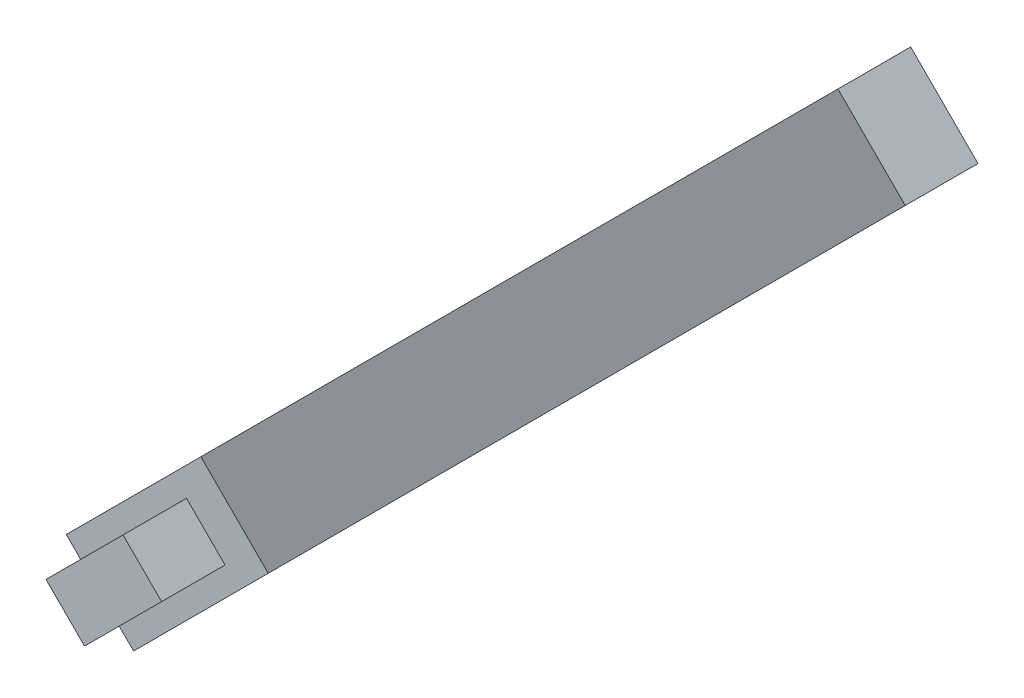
ISO-10303-21;
HEADER;
FILE_DESCRIPTION(('STEP AP214'),'2;1');
FILE_NAME('part.step','',(''),(''),'','','');
FILE_SCHEMA(('AUTOMOTIVE_DESIGN { 1 0 10303 214 1 1 1 1 }'));
ENDSEC;
DATA;
#1=APPLICATION_CONTEXT('core data for automotive mechanical design processes');
#2=APPLICATION_PROTOCOL_DEFINITION('international standard','automotive_design',2000,#1);
#3=PRODUCT_CONTEXT('',#1,'mechanical');
#4=PRODUCT('Part','Part','',(#3));
#5=PRODUCT_RELATED_PRODUCT_CATEGORY('part','',(#4));
#6=PRODUCT_DEFINITION_FORMATION('','',#4);
#7=PRODUCT_DEFINITION_CONTEXT('part definition',#1,'design');
#8=PRODUCT_DEFINITION('design','',#6,#7);
#9=PRODUCT_DEFINITION_SHAPE('','',#8);
#10=(LENGTH_UNIT() NAMED_UNIT(*) SI_UNIT(.MILLI.,.METRE.));
#11=(NAMED_UNIT(*) PLANE_ANGLE_UNIT() SI_UNIT($,.RADIAN.));
#12=(NAMED_UNIT(*) SI_UNIT($,.STERADIAN.) SOLID_ANGLE_UNIT());
#13=UNCERTAINTY_MEASURE_WITH_UNIT(LENGTH_MEASURE(1.E-05),#10,'distance_accuracy_value','');
#14=(GEOMETRIC_REPRESENTATION_CONTEXT(3) GLOBAL_UNCERTAINTY_ASSIGNED_CONTEXT((#13)) GLOBAL_UNIT_ASSIGNED_CONTEXT((#10,
#11,#12)) REPRESENTATION_CONTEXT('',''));
#15=CARTESIAN_POINT('',(0.,0.,0.));
#16=DIRECTION('',(0.,0.,1.));
#17=DIRECTION('',(1.,0.,0.));
#18=AXIS2_PLACEMENT_3D('',#15,#16,#17);
#19=CARTESIAN_POINT('',(-185.409136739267,-30.0866021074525,320.41610029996));
#20=DIRECTION('',(0.,0.,1.));
#21=DIRECTION('',(1.,0.,0.));
#22=AXIS2_PLACEMENT_3D('',#19,#20,#21);
#23=PLANE('',#22);
#24=DIRECTION('',(-0.707106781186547,0.707106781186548,0.));
#25=VECTOR('',#24,1.);
#26=CARTESIAN_POINT('',(-167.19596071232,-24.0155434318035,320.41610029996));
#27=LINE('',#26,#25);
#28=CARTESIAN_POINT('',(-179.338078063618,-11.8734260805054,320.41610029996));
#29=VERTEX_POINT('',#28);
#30=CARTESIAN_POINT('',(-167.19596071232,-24.0155434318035,320.41610029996));
#31=VERTEX_POINT('',#30);
#32=EDGE_CURVE('E104',#29,#31,#27,.F.);
#33=ORIENTED_EDGE('',*,*,#32,.F.);
#34=DIRECTION('',(-0.707106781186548,-0.707106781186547,0.));
#35=VECTOR('',#34,1.);
#36=CARTESIAN_POINT('',(-179.338078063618,-11.8734260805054,320.41610029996));
#37=LINE('',#36,#35);
#38=CARTESIAN_POINT('',(-203.622312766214,-36.1576607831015,320.41610029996));
#39=VERTEX_POINT('',#38);
#40=EDGE_CURVE('E20',#39,#29,#37,.F.);
#41=ORIENTED_EDGE('',*,*,#40,.F.);
#42=DIRECTION('',(0.707106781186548,-0.707106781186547,0.));
#43=VECTOR('',#42,1.);
#44=CARTESIAN_POINT('',(-203.622312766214,-36.1576607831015,320.41610029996));
#45=LINE('',#44,#43);
#46=CARTESIAN_POINT('',(-191.480195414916,-48.2997781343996,320.41610029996));
#47=VERTEX_POINT('',#46);
#48=EDGE_CURVE('E138',#47,#39,#45,.F.);
#49=ORIENTED_EDGE('',*,*,#48,.F.);
#50=DIRECTION('',(0.707106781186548,0.707106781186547,0.));
#51=VECTOR('',#50,1.);
#52=CARTESIAN_POINT('',(-191.480195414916,-48.2997781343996,320.41610029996));
#53=LINE('',#52,#51);
#54=EDGE_CURVE('E118',#31,#47,#53,.F.);
#55=ORIENTED_EDGE('',*,*,#54,.F.);
#56=EDGE_LOOP('',(#33,#41,#49,#55));
#57=FACE_BOUND('',#56,.T.);
#58=ADVANCED_FACE('F17',(#57),#23,.T.);
#59=CARTESIAN_POINT('',(-179.338078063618,-11.8734260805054,300.41610029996));
#60=DIRECTION('',(-0.707106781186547,0.707106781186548,0.));
#61=DIRECTION('',(-0.707106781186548,-0.707106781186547,0.));
#62=AXIS2_PLACEMENT_3D('',#59,#60,#61);
#63=PLANE('',#62);
#64=ORIENTED_EDGE('',*,*,#40,.T.);
#65=DIRECTION('',(0.,0.,1.));
#66=VECTOR('',#65,1.);
#67=CARTESIAN_POINT('',(-179.338078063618,-11.8734260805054,300.41610029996));
#68=LINE('',#67,#66);
#69=CARTESIAN_POINT('',(-179.338078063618,-11.8734260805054,300.41610029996));
#70=VERTEX_POINT('',#69);
#71=EDGE_CURVE('E110',#70,#29,#68,.T.);
#72=ORIENTED_EDGE('',*,*,#71,.F.);
#73=DIRECTION('',(0.707106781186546,0.707106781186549,0.));
#74=VECTOR('',#73,1.);
#75=CARTESIAN_POINT('',(-203.622312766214,-36.1576607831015,300.41610029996));
#76=LINE('',#75,#74);
#77=CARTESIAN_POINT('',(-203.622312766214,-36.1576607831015,300.41610029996));
#78=VERTEX_POINT('',#77);
#79=EDGE_CURVE('E153',#78,#70,#76,.T.);
#80=ORIENTED_EDGE('',*,*,#79,.F.);
#81=DIRECTION('',(0.,0.,1.));
#82=VECTOR('',#81,1.);
#83=CARTESIAN_POINT('',(-203.622312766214,-36.1576607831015,300.41610029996));
#84=LINE('',#83,#82);
#85=EDGE_CURVE('E113',#39,#78,#84,.F.);
#86=ORIENTED_EDGE('',*,*,#85,.F.);
#87=EDGE_LOOP('',(#64,#72,#80,#86));
#88=FACE_BOUND('',#87,.T.);
#89=ADVANCED_FACE('F109',(#88),#63,.T.);
#90=CARTESIAN_POINT('',(-167.19596071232,-24.0155434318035,300.41610029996));
#91=DIRECTION('',(0.707106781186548,0.707106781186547,0.));
#92=DIRECTION('',(-0.707106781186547,0.707106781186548,0.));
#93=AXIS2_PLACEMENT_3D('',#90,#91,#92);
#94=PLANE('',#93);
#95=ORIENTED_EDGE('',*,*,#32,.T.);
#96=DIRECTION('',(0.,0.,1.));
#97=VECTOR('',#96,1.);
#98=CARTESIAN_POINT('',(-167.19596071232,-24.0155434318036,300.41610029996));
#99=LINE('',#98,#97);
#100=CARTESIAN_POINT('',(-167.19596071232,-24.0155434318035,300.41610029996));
#101=VERTEX_POINT('',#100);
#102=EDGE_CURVE('E121',#101,#31,#99,.T.);
#103=ORIENTED_EDGE('',*,*,#102,.F.);
#104=DIRECTION('',(0.707106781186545,-0.707106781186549,0.));
#105=VECTOR('',#104,1.);
#106=CARTESIAN_POINT('',(-179.338078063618,-11.8734260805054,300.41610029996));
#107=LINE('',#106,#105);
#108=EDGE_CURVE('E125',#70,#101,#107,.T.);
#109=ORIENTED_EDGE('',*,*,#108,.F.);
#110=ORIENTED_EDGE('',*,*,#71,.T.);
#111=EDGE_LOOP('',(#95,#103,#109,#110));
#112=FACE_BOUND('',#111,.T.);
#113=ADVANCED_FACE('F123',(#112),#94,.T.);
#114=CARTESIAN_POINT('',(-191.480195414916,-48.2997781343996,300.41610029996));
#115=DIRECTION('',(0.707106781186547,-0.707106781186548,0.));
#116=DIRECTION('',(0.707106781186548,0.707106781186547,0.));
#117=AXIS2_PLACEMENT_3D('',#114,#115,#116);
#118=PLANE('',#117);
#119=ORIENTED_EDGE('',*,*,#54,.T.);
#120=DIRECTION('',(0.,0.,1.));
#121=VECTOR('',#120,1.);
#122=CARTESIAN_POINT('',(-191.480195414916,-48.2997781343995,300.41610029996));
#123=LINE('',#122,#121);
#124=CARTESIAN_POINT('',(-191.480195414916,-48.2997781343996,300.41610029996));
#125=VERTEX_POINT('',#124);
#126=EDGE_CURVE('E134',#125,#47,#123,.T.);
#127=ORIENTED_EDGE('',*,*,#126,.F.);
#128=DIRECTION('',(-0.707106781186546,-0.707106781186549,0.));
#129=VECTOR('',#128,1.);
#130=CARTESIAN_POINT('',(-167.19596071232,-24.0155434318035,300.41610029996));
#131=LINE('',#130,#129);
#132=EDGE_CURVE('E158',#101,#125,#131,.T.);
#133=ORIENTED_EDGE('',*,*,#132,.F.);
#134=ORIENTED_EDGE('',*,*,#102,.T.);
#135=EDGE_LOOP('',(#119,#127,#133,#134));
#136=FACE_BOUND('',#135,.T.);
#137=ADVANCED_FACE('F360',(#136),#118,.T.);
#138=CARTESIAN_POINT('',(-203.622312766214,-36.1576607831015,300.41610029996));
#139=DIRECTION('',(-0.707106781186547,-0.707106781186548,0.));
#140=DIRECTION('',(0.707106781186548,-0.707106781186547,0.));
#141=AXIS2_PLACEMENT_3D('',#138,#139,#140);
#142=PLANE('',#141);
#143=ORIENTED_EDGE('',*,*,#48,.T.);
#144=ORIENTED_EDGE('',*,*,#85,.T.);
#145=DIRECTION('',(-0.707106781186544,0.707106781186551,0.));
#146=VECTOR('',#145,1.);
#147=CARTESIAN_POINT('',(-191.480195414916,-48.2997781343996,300.41610029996));
#148=LINE('',#147,#146);
#149=EDGE_CURVE('E162',#125,#78,#148,.T.);
#150=ORIENTED_EDGE('',*,*,#149,.F.);
#151=ORIENTED_EDGE('',*,*,#126,.T.);
#152=EDGE_LOOP('',(#143,#144,#150,#151));
#153=FACE_BOUND('',#152,.T.);
#154=ADVANCED_FACE('F352',(#153),#142,.T.);
#155=CARTESIAN_POINT('',(-230.832457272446,-54.2967192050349,165.20805014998));
#156=DIRECTION('',(-0.707106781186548,0.707106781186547,0.));
#157=DIRECTION('',(-0.707106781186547,-0.707106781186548,0.));
#158=AXIS2_PLACEMENT_3D('',#155,#156,#157);
#159=PLANE('',#158);
#160=DIRECTION('',(0.241960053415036,0.241960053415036,0.939633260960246));
#161=VECTOR('',#160,1.);
#162=CARTESIAN_POINT('',(-286.862379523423,-110.326641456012,30.));
#163=LINE('',#162,#161);
#164=CARTESIAN_POINT('',(-217.228941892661,-40.6932038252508,300.41610029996));
#165=VERTEX_POINT('',#164);
#166=CARTESIAN_POINT('',(-286.862379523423,-110.326641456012,30.));
#167=VERTEX_POINT('',#166);
#168=EDGE_CURVE('E170',#165,#167,#163,.F.);
#169=ORIENTED_EDGE('',*,*,#168,.F.);
#170=DIRECTION('',(-0.707106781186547,-0.707106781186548,0.));
#171=VECTOR('',#170,1.);
#172=CARTESIAN_POINT('',(-174.802535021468,1.73320304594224,300.41610029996));
#173=LINE('',#172,#171);
#174=CARTESIAN_POINT('',(-174.802535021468,1.73320304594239,300.41610029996));
#175=VERTEX_POINT('',#174);
#176=EDGE_CURVE('E150',#175,#165,#173,.T.);
#177=ORIENTED_EDGE('',*,*,#176,.F.);
#178=DIRECTION('',(0.241960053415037,0.241960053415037,0.939633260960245));
#179=VECTOR('',#178,1.);
#180=CARTESIAN_POINT('',(-174.802535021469,1.73320304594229,300.41610029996));
#181=LINE('',#180,#179);
#182=CARTESIAN_POINT('',(-244.43597265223,-67.9002345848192,30.));
#183=VERTEX_POINT('',#182);
#184=EDGE_CURVE('E143',#183,#175,#181,.T.);
#185=ORIENTED_EDGE('',*,*,#184,.F.);
#186=DIRECTION('',(0.707106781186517,0.707106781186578,0.));
#187=VECTOR('',#186,1.);
#188=CARTESIAN_POINT('',(-251.507040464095,-74.9713023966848,30.));
#189=LINE('',#188,#187);
#190=CARTESIAN_POINT('',(-251.507040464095,-74.9713023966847,30.));
#191=VERTEX_POINT('',#190);
#192=EDGE_CURVE('E203',#191,#183,#189,.T.);
#193=ORIENTED_EDGE('',*,*,#192,.F.);
#194=DIRECTION('',(0.,0.,1.));
#195=VECTOR('',#194,1.);
#196=CARTESIAN_POINT('',(-251.507040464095,-74.9713023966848,30.));
#197=LINE('',#196,#195);
#198=CARTESIAN_POINT('',(-251.507040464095,-74.9713023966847,0.));
#199=VERTEX_POINT('',#198);
#200=EDGE_CURVE('E198',#199,#191,#197,.T.);
#201=ORIENTED_EDGE('',*,*,#200,.F.);
#202=DIRECTION('',(0.707106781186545,0.70710678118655,0.));
#203=VECTOR('',#202,1.);
#204=CARTESIAN_POINT('',(-279.791311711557,-103.255573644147,0.));
#205=LINE('',#204,#203);
#206=CARTESIAN_POINT('',(-279.791311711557,-103.255573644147,0.));
#207=VERTEX_POINT('',#206);
#208=EDGE_CURVE('E191',#207,#199,#205,.T.);
#209=ORIENTED_EDGE('',*,*,#208,.F.);
#210=DIRECTION('',(0.,0.,1.));
#211=VECTOR('',#210,1.);
#212=CARTESIAN_POINT('',(-279.791311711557,-103.255573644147,30.));
#213=LINE('',#212,#211);
#214=CARTESIAN_POINT('',(-279.791311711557,-103.255573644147,30.));
#215=VERTEX_POINT('',#214);
#216=EDGE_CURVE('E184',#215,#207,#213,.F.);
#217=ORIENTED_EDGE('',*,*,#216,.F.);
#218=DIRECTION('',(0.707106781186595,0.7071067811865,0.));
#219=VECTOR('',#218,1.);
#220=CARTESIAN_POINT('',(-286.862379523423,-110.326641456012,30.));
#221=LINE('',#220,#219);
#222=EDGE_CURVE('E177',#167,#215,#221,.T.);
#223=ORIENTED_EDGE('',*,*,#222,.F.);
#224=EDGE_LOOP('',(#169,#177,#185,#193,#201,#209,#217,#223));
#225=FACE_BOUND('',#224,.T.);
#226=ADVANCED_FACE('F249',(#225),#159,.T.);
#227=CARTESIAN_POINT('',(-153.589331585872,-19.4800003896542,300.41610029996));
#228=DIRECTION('',(0.664421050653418,0.664421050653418,-0.342183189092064));
#229=DIRECTION('',(-0.707106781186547,0.707106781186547,0.));
#230=AXIS2_PLACEMENT_3D('',#227,#228,#229);
#231=PLANE('',#230);
#232=ORIENTED_EDGE('',*,*,#184,.T.);
#233=DIRECTION('',(-0.70710678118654,0.707106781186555,0.));
#234=VECTOR('',#233,1.);
#235=CARTESIAN_POINT('',(-153.589331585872,-19.4800003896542,300.41610029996));
#236=LINE('',#235,#234);
#237=CARTESIAN_POINT('',(-153.589331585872,-19.4800003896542,300.41610029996));
#238=VERTEX_POINT('',#237);
#239=EDGE_CURVE('E146',#238,#175,#236,.T.);
#240=ORIENTED_EDGE('',*,*,#239,.F.);
#241=DIRECTION('',(0.241960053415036,0.241960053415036,0.939633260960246));
#242=VECTOR('',#241,1.);
#243=CARTESIAN_POINT('',(-223.222769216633,-89.1134380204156,30.));
#244=LINE('',#243,#242);
#245=CARTESIAN_POINT('',(-223.222769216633,-89.1134380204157,30.0000000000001));
#246=VERTEX_POINT('',#245);
#247=EDGE_CURVE('E211',#246,#238,#244,.T.);
#248=ORIENTED_EDGE('',*,*,#247,.F.);
#249=DIRECTION('',(0.707106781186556,-0.707106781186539,0.));
#250=VECTOR('',#249,1.);
#251=CARTESIAN_POINT('',(-244.43597265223,-67.9002345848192,30.));
#252=LINE('',#251,#250);
#253=EDGE_CURVE('E207',#183,#246,#252,.T.);
#254=ORIENTED_EDGE('',*,*,#253,.F.);
#255=EDGE_LOOP('',(#232,#240,#248,#254));
#256=FACE_BOUND('',#255,.T.);
#257=ADVANCED_FACE('F255',(#256),#231,.T.);
#258=CARTESIAN_POINT('',(-196.015738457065,-61.9064072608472,300.41610029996));
#259=DIRECTION('',(0.,0.,1.));
#260=DIRECTION('',(1.,0.,0.));
#261=AXIS2_PLACEMENT_3D('',#258,#259,#260);
#262=PLANE('',#261);
#263=ORIENTED_EDGE('',*,*,#132,.T.);
#264=ORIENTED_EDGE('',*,*,#149,.T.);
#265=ORIENTED_EDGE('',*,*,#79,.T.);
#266=ORIENTED_EDGE('',*,*,#108,.T.);
#267=EDGE_LOOP('',(#263,#264,#265,#266));
#268=FACE_BOUND('',#267,.T.);
#269=ORIENTED_EDGE('',*,*,#176,.T.);
#270=DIRECTION('',(0.707106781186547,-0.707106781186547,0.));
#271=VECTOR('',#270,1.);
#272=CARTESIAN_POINT('',(-196.015738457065,-61.9064072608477,300.41610029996));
#273=LINE('',#272,#271);
#274=CARTESIAN_POINT('',(-196.015738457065,-61.9064072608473,300.41610029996));
#275=VERTEX_POINT('',#274);
#276=EDGE_CURVE('E166',#275,#165,#273,.F.);
#277=ORIENTED_EDGE('',*,*,#276,.F.);
#278=DIRECTION('',(0.707106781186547,0.707106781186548,0.));
#279=VECTOR('',#278,1.);
#280=CARTESIAN_POINT('',(-209.619253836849,-75.5099226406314,300.41610029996));
#281=LINE('',#280,#279);
#282=EDGE_CURVE('E215',#238,#275,#281,.F.);
#283=ORIENTED_EDGE('',*,*,#282,.F.);
#284=ORIENTED_EDGE('',*,*,#239,.T.);
#285=EDGE_LOOP('',(#269,#277,#283,#284));
#286=FACE_BOUND('',#285,.T.);
#287=ADVANCED_FACE('F259',(#268,#286),#262,.T.);
#288=CARTESIAN_POINT('',(-265.649176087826,-131.539844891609,30.));
#289=DIRECTION('',(-0.664421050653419,-0.664421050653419,0.342183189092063));
#290=DIRECTION('',(0.707106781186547,-0.707106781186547,0.));
#291=AXIS2_PLACEMENT_3D('',#288,#289,#290);
#292=PLANE('',#291);
#293=ORIENTED_EDGE('',*,*,#168,.T.);
#294=DIRECTION('',(-0.707106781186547,0.707106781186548,0.));
#295=VECTOR('',#294,1.);
#296=CARTESIAN_POINT('',(-265.649176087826,-131.539844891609,30.));
#297=LINE('',#296,#295);
#298=CARTESIAN_POINT('',(-265.649176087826,-131.539844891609,30.));
#299=VERTEX_POINT('',#298);
#300=EDGE_CURVE('E173',#299,#167,#297,.T.);
#301=ORIENTED_EDGE('',*,*,#300,.F.);
#302=DIRECTION('',(-0.241960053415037,-0.241960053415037,-0.939633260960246));
#303=VECTOR('',#302,1.);
#304=CARTESIAN_POINT('',(-196.015738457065,-61.9064072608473,300.41610029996));
#305=LINE('',#304,#303);
#306=EDGE_CURVE('E219',#275,#299,#305,.T.);
#307=ORIENTED_EDGE('',*,*,#306,.F.);
#308=ORIENTED_EDGE('',*,*,#276,.T.);
#309=EDGE_LOOP('',(#293,#301,#307,#308));
#310=FACE_BOUND('',#309,.T.);
#311=ADVANCED_FACE('F261',(#310),#292,.T.);
#312=CARTESIAN_POINT('',(-223.222769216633,-89.1134380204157,30.));
#313=DIRECTION('',(0.,0.,-1.));
#314=DIRECTION('',(-1.,0.,0.));
#315=AXIS2_PLACEMENT_3D('',#312,#313,#314);
#316=PLANE('',#315);
#317=ORIENTED_EDGE('',*,*,#300,.T.);
#318=ORIENTED_EDGE('',*,*,#222,.T.);
#319=DIRECTION('',(0.707106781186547,-0.707106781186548,0.));
#320=VECTOR('',#319,1.);
#321=CARTESIAN_POINT('',(-258.578108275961,-124.468777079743,30.));
#322=LINE('',#321,#320);
#323=CARTESIAN_POINT('',(-258.578108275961,-124.468777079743,30.));
#324=VERTEX_POINT('',#323);
#325=EDGE_CURVE('E180',#324,#215,#322,.F.);
#326=ORIENTED_EDGE('',*,*,#325,.F.);
#327=DIRECTION('',(0.707106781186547,0.707106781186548,0.));
#328=VECTOR('',#327,1.);
#329=CARTESIAN_POINT('',(-209.619253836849,-75.5099226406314,30.));
#330=LINE('',#329,#328);
#331=EDGE_CURVE('E223',#299,#324,#330,.T.);
#332=ORIENTED_EDGE('',*,*,#331,.F.);
#333=EDGE_LOOP('',(#317,#318,#326,#332));
#334=FACE_BOUND('',#333,.T.);
#335=ADVANCED_FACE('F265',(#334),#316,.T.);
#336=CARTESIAN_POINT('',(-258.578108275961,-124.468777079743,30.));
#337=DIRECTION('',(-0.707106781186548,-0.707106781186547,0.));
#338=DIRECTION('',(0.707106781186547,-0.707106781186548,0.));
#339=AXIS2_PLACEMENT_3D('',#336,#337,#338);
#340=PLANE('',#339);
#341=DIRECTION('',(-0.707106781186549,0.707106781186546,0.));
#342=VECTOR('',#341,1.);
#343=CARTESIAN_POINT('',(-258.578108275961,-124.468777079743,0.));
#344=LINE('',#343,#342);
#345=CARTESIAN_POINT('',(-258.578108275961,-124.468777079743,0.));
#346=VERTEX_POINT('',#345);
#347=EDGE_CURVE('E187',#346,#207,#344,.T.);
#348=ORIENTED_EDGE('',*,*,#347,.F.);
#349=DIRECTION('',(0.,0.,1.));
#350=VECTOR('',#349,1.);
#351=CARTESIAN_POINT('',(-258.578108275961,-124.468777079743,165.20805014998));
#352=LINE('',#351,#350);
#353=EDGE_CURVE('E227',#324,#346,#352,.F.);
#354=ORIENTED_EDGE('',*,*,#353,.F.);
#355=ORIENTED_EDGE('',*,*,#325,.T.);
#356=ORIENTED_EDGE('',*,*,#216,.T.);
#357=EDGE_LOOP('',(#348,#354,#355,#356));
#358=FACE_BOUND('',#357,.T.);
#359=ADVANCED_FACE('F268',(#358),#340,.T.);
#360=CARTESIAN_POINT('',(-255.042574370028,-99.7200397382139,0.));
#361=DIRECTION('',(0.,0.,-1.));
#362=DIRECTION('',(-1.,0.,0.));
#363=AXIS2_PLACEMENT_3D('',#360,#361,#362);
#364=PLANE('',#363);
#365=ORIENTED_EDGE('',*,*,#347,.T.);
#366=ORIENTED_EDGE('',*,*,#208,.T.);
#367=DIRECTION('',(-0.707106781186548,0.707106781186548,0.));
#368=VECTOR('',#367,1.);
#369=CARTESIAN_POINT('',(-251.507040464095,-74.9713023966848,0.));
#370=LINE('',#369,#368);
#371=CARTESIAN_POINT('',(-230.293837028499,-96.1845058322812,0.));
#372=VERTEX_POINT('',#371);
#373=EDGE_CURVE('E194',#372,#199,#370,.T.);
#374=ORIENTED_EDGE('',*,*,#373,.F.);
#375=DIRECTION('',(0.707106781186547,0.707106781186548,0.));
#376=VECTOR('',#375,1.);
#377=CARTESIAN_POINT('',(-209.619253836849,-75.5099226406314,0.));
#378=LINE('',#377,#376);
#379=EDGE_CURVE('E231',#346,#372,#378,.T.);
#380=ORIENTED_EDGE('',*,*,#379,.F.);
#381=EDGE_LOOP('',(#365,#366,#374,#380));
#382=FACE_BOUND('',#381,.T.);
#383=ADVANCED_FACE('F244',(#382),#364,.T.);
#384=CARTESIAN_POINT('',(-251.507040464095,-74.9713023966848,30.));
#385=DIRECTION('',(0.707106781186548,0.707106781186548,0.));
#386=DIRECTION('',(-0.707106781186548,0.707106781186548,0.));
#387=AXIS2_PLACEMENT_3D('',#384,#385,#386);
#388=PLANE('',#387);
#389=ORIENTED_EDGE('',*,*,#373,.T.);
#390=ORIENTED_EDGE('',*,*,#200,.T.);
#391=DIRECTION('',(-0.707106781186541,0.707106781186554,0.));
#392=VECTOR('',#391,1.);
#393=CARTESIAN_POINT('',(-230.293837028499,-96.1845058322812,30.));
#394=LINE('',#393,#392);
#395=CARTESIAN_POINT('',(-230.293837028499,-96.1845058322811,30.));
#396=VERTEX_POINT('',#395);
#397=EDGE_CURVE('E36',#396,#191,#394,.T.);
#398=ORIENTED_EDGE('',*,*,#397,.F.);
#399=DIRECTION('',(0.,0.,1.));
#400=VECTOR('',#399,1.);
#401=CARTESIAN_POINT('',(-230.293837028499,-96.1845058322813,165.20805014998));
#402=LINE('',#401,#400);
#403=EDGE_CURVE('E27',#372,#396,#402,.T.);
#404=ORIENTED_EDGE('',*,*,#403,.F.);
#405=EDGE_LOOP('',(#389,#390,#398,#404));
#406=FACE_BOUND('',#405,.T.);
#407=ADVANCED_FACE('F240',(#406),#388,.T.);
#408=CARTESIAN_POINT('',(-223.222769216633,-89.1134380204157,30.));
#409=DIRECTION('',(0.,0.,-1.));
#410=DIRECTION('',(-1.,0.,0.));
#411=AXIS2_PLACEMENT_3D('',#408,#409,#410);
#412=PLANE('',#411);
#413=ORIENTED_EDGE('',*,*,#253,.T.);
#414=DIRECTION('',(0.707106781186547,0.707106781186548,0.));
#415=VECTOR('',#414,1.);
#416=CARTESIAN_POINT('',(-209.619253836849,-75.5099226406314,30.));
#417=LINE('',#416,#415);
#418=EDGE_CURVE('E11',#396,#246,#417,.T.);
#419=ORIENTED_EDGE('',*,*,#418,.F.);
#420=ORIENTED_EDGE('',*,*,#397,.T.);
#421=ORIENTED_EDGE('',*,*,#192,.T.);
#422=EDGE_LOOP('',(#413,#419,#420,#421));
#423=FACE_BOUND('',#422,.T.);
#424=ADVANCED_FACE('F253',(#423),#412,.T.);
#425=CARTESIAN_POINT('',(-209.619253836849,-75.5099226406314,165.20805014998));
#426=DIRECTION('',(0.707106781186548,-0.707106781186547,0.));
#427=DIRECTION('',(0.707106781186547,0.707106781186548,0.));
#428=AXIS2_PLACEMENT_3D('',#425,#426,#427);
#429=PLANE('',#428);
#430=ORIENTED_EDGE('',*,*,#403,.T.);
#431=ORIENTED_EDGE('',*,*,#418,.T.);
#432=ORIENTED_EDGE('',*,*,#247,.T.);
#433=ORIENTED_EDGE('',*,*,#282,.T.);
#434=ORIENTED_EDGE('',*,*,#306,.T.);
#435=ORIENTED_EDGE('',*,*,#331,.T.);
#436=ORIENTED_EDGE('',*,*,#353,.T.);
#437=ORIENTED_EDGE('',*,*,#379,.T.);
#438=EDGE_LOOP('',(#430,#431,#432,#433,#434,#435,#436,#437));
#439=FACE_BOUND('',#438,.T.);
#440=ADVANCED_FACE('F238',(#439),#429,.T.);
#441=CLOSED_SHELL('',(#58,#89,#113,#137,#154,#226,#257,#287,#311,#335,#359,#383,#407,#424,#440));
#442=MANIFOLD_SOLID_BREP('B1',#441);
#443=ADVANCED_BREP_SHAPE_REPRESENTATION('',(#18,#442),#14);
#444=SHAPE_DEFINITION_REPRESENTATION(#9,#443);
ENDSEC;
END-ISO-10303-21;
